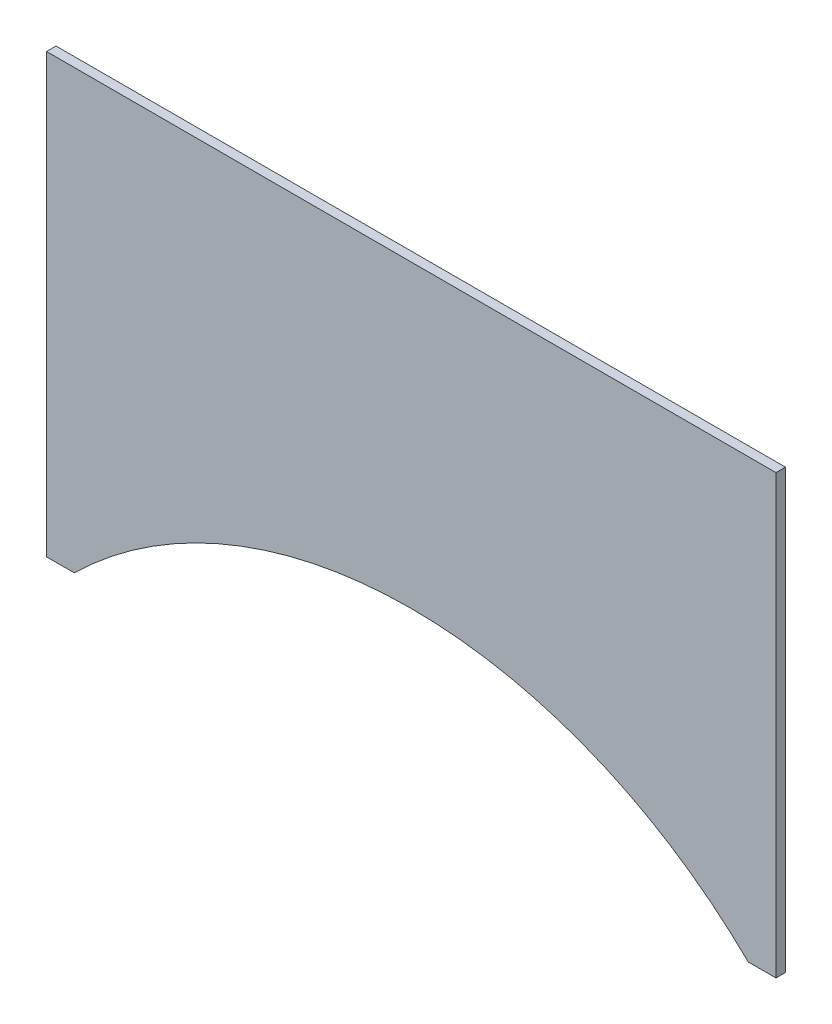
from build123d import *

# Parameters (mm, degrees)
BOSS_EXTRUDE2_DEPTH = 13


with BuildPart() as part:
    # Sketch2 → Boss-Extrude2 (new body)
    with BuildSketch(Plane.XY):
        with BuildLine():
            Line((-484.223432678, -431.698113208), (-446.223432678, -431.698113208))
            ThreePointArc((-446.223432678, -431.698113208), (15.776567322, -243.032389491), (477.776567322, -431.698113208))
            Line((477.776567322, -431.698113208), (515.776567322, -431.698113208))
            Line((515.776567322, -431.698113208), (515.776567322, 168.301886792))
            Line((515.776567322, 168.301886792), (-484.223432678, 168.301886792))
            Line((-484.223432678, 168.301886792), (-484.223432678, -431.698113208))
        make_face()
    extrude(amount=BOSS_EXTRUDE2_DEPTH)


solid = part.part
